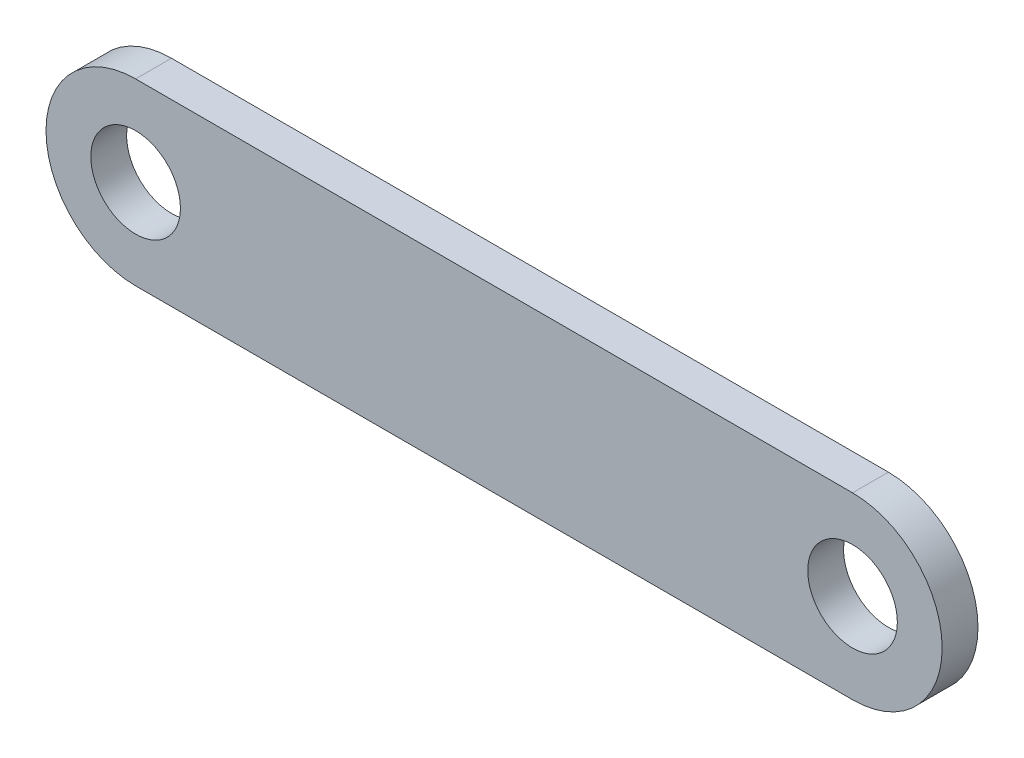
from build123d import *

# Parameters (mm, degrees)
SKETCH1_R           = 2.5
BOSS_EXTRUDE1_DEPTH = 1


with BuildPart() as part:
    # Sketch1 → Boss-Extrude1 (new, symmetric)
    with BuildSketch(Plane.XY):
        with BuildLine():
            Line((-20, 5), (20, 5))
            ThreePointArc((20, 5), (25, 0), (20, -5))
            Line((20, -5), (-20, -5))
            ThreePointArc((-20, -5), (-25, 0), (-20, 5))
        make_face()
        with Locations((-20, 0)):
            Circle(SKETCH1_R, mode=Mode.SUBTRACT)
        with Locations((20, 0)):
            Circle(SKETCH1_R, mode=Mode.SUBTRACT)
    extrude(amount=BOSS_EXTRUDE1_DEPTH, both=True)


solid = part.part
